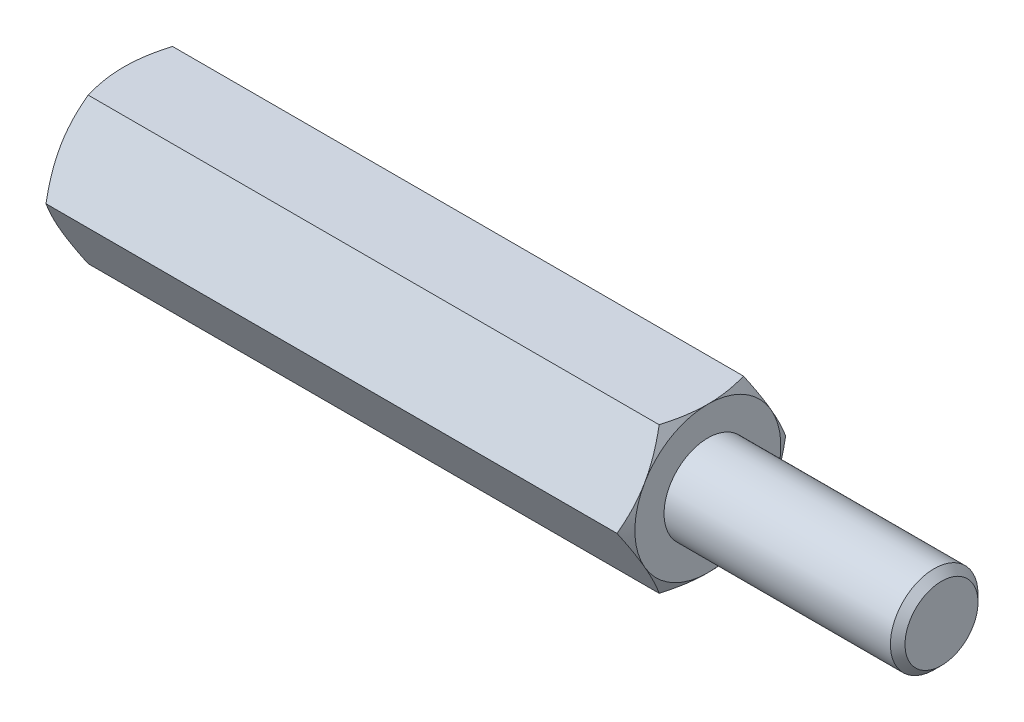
from build123d import *

# Parameters (mm, degrees)
EXTRUDE2_DEPTH = 10
SKETCH3_R      = 1.25
EXTRUDE3_DEPTH = 8
SKETCH5_R      = 1.5
EXTRUDE4_DEPTH = 8
CHAMFER1_SIZE  = 0.25


with BuildPart() as part:
    # Sketch1 → Extrude2 (new, symmetric)
    with BuildSketch(Plane(origin=(0, 0, 0), x_dir=(0, 0, -1), z_dir=(1, 0, 0))):
        Polygon((1.443375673, 2.5), (-1.443375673, 2.5), (-2.886751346, 0), (-1.443375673, -2.5), (1.443375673, -2.5), (2.886751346, 0), align=None)
    extrude(amount=EXTRUDE2_DEPTH, both=True)

    # Sketch2 → Cut-Revolve1 (revolve, cut)
    with BuildSketch(Plane.XY):
        with BuildLine():
            Line((-10, 2.5), (-8.5, 5.098076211))
            ThreePointArc((-8.5, 5.098076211), (-8.98810136, 6.276457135), (-10, 5.5))
            Line((-10, 5.5), (-10, 2.5))
        make_face()
    cut_revolve1 = revolve(axis=Axis((0, 0, 0), (1, 0, 0)), mode=Mode.SUBTRACT)

    # Mirror1: Cut-Revolve1 across plane
    add(cut_revolve1.mirror(Plane(origin=(0, 0, 0), x_dir=(0, 0, 1), z_dir=(1, 0, 0))), mode=Mode.SUBTRACT)

    # Sketch3 → Extrude3 (cut)
    with BuildSketch(Plane.ZY.offset(10)):
        Circle(SKETCH3_R)
    extrude(amount=-EXTRUDE3_DEPTH, mode=Mode.SUBTRACT)

    # Sketch4 → Cut-Revolve2 (revolve, cut)
    with BuildSketch(Plane.XY, mode=Mode.PRIVATE) as cut_revolve2_sk:
        Polygon((-2, 0), (-2, 1.25), (-1.278312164, 0), align=None)
    revolve(cut_revolve2_sk.sketch.rotate(Axis((-1.278312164, 0, 0), (-1, 0, 0)), 180), axis=Axis((-1.278312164, 0, 0), (-1, 0, 0)), mode=Mode.SUBTRACT)

    # Sketch5 → Extrude4 (add)
    with BuildSketch(Plane(origin=(10, 0, 0), x_dir=(0, 0, -1), z_dir=(1, 0, 0))):
        Circle(SKETCH5_R)
    extrude(amount=EXTRUDE4_DEPTH)

    # Chamfer1
    chamfer1_edges = [part.edges().sort_by_distance(p)[0] for p in [
        (18, 0, 1.5),
    ]]
    chamfer(chamfer1_edges, length=CHAMFER1_SIZE)


solid = part.part
